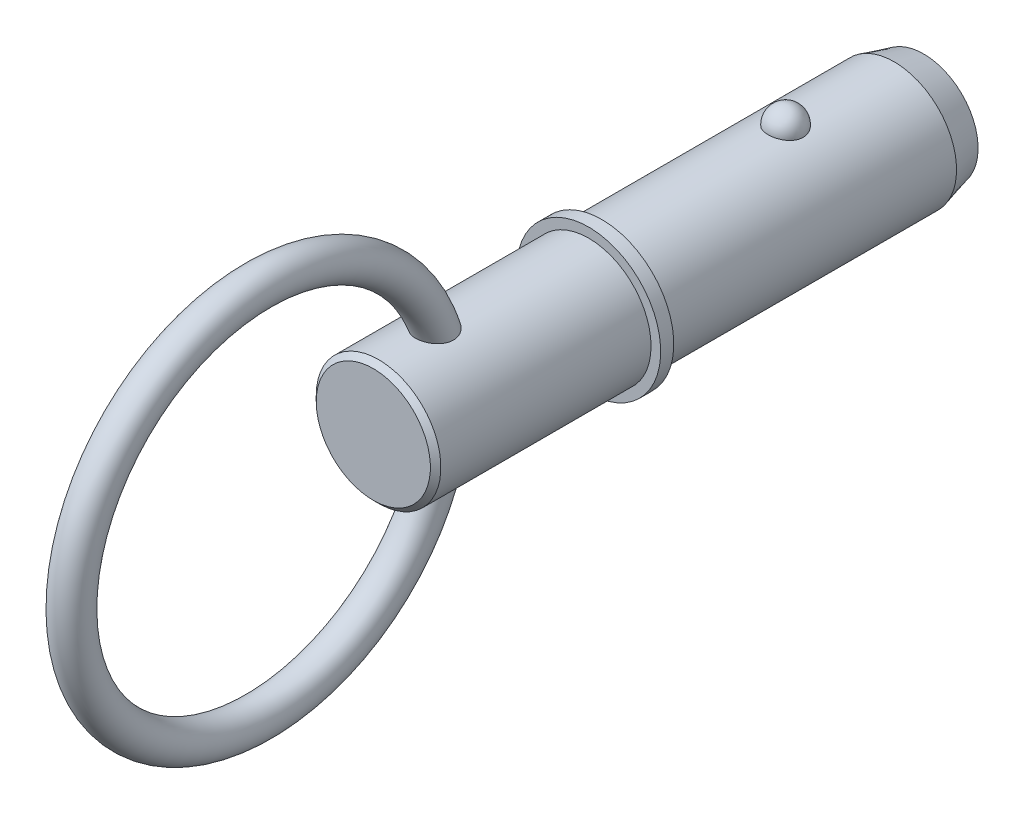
from build123d import *

# Parameters (mm, degrees)
SKETCH2_R           = 9.525
BOSS_EXTRUDE1_DEPTH = 25.4
BOSS_EXTRUDE2_START = 23.8
SKETCH3_R           = 9.525
BOSS_EXTRUDE2_DEPTH = 23.8
CHAMFER1_SIZE       = 4.5
CHAMFER1_SIZE2      = 1.205771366
SKETCH20_W          = 2
SKETCH20_H          = 11
SKETCH21_R          = 9.525
BOSS_EXTRUDE3_DEPTH = 34.93
CHAMFER2_SIZE       = 0.8
SKETCH24_R          = 2.75


with BuildPart() as part:
    # Sketch2 → Boss-Extrude1 (new body)
    with BuildSketch(Plane.XY):
        Circle(SKETCH2_R)
    extrude(amount=BOSS_EXTRUDE1_DEPTH)

    # Sketch3 → Boss-Extrude2 (add)
    with BuildSketch(Plane(origin=(0, 0, 0), x_dir=(-1, 0, 0), z_dir=(0, 0, -1)).offset(BOSS_EXTRUDE2_START)):
        Circle(SKETCH3_R)
    extrude(amount=-BOSS_EXTRUDE2_DEPTH)

    # Chamfer1
    chamfer1_edges = [part.edges().sort_by_distance(p)[0] for p in [
        (9.525, 0, -23.8),
    ]]
    chamfer1_side = [part.faces().sort_by_distance(p)[0] for p in [
        (9.525, 0, -11.9),
    ]]
    chamfer(chamfer1_edges, length=CHAMFER1_SIZE, length2=CHAMFER1_SIZE2, reference=chamfer1_side[0])

    # Sketch18 → Revolve1 (revolve)
    with BuildSketch(Plane(origin=(0, 0, 0), x_dir=(0, 0, -1), z_dir=(1, 0, 0))):
        with BuildLine():
            Line((2.69, 12.215), (2.69, 6.835))
            ThreePointArc((2.69, 6.835), (0, 9.525), (2.69, 12.215))
        make_face()
    revolve(axis=Axis((0, 12.215, -2.69), (0, -1, 0)))

    # Sketch20 → Revolve2 (revolve)
    with BuildSketch(Plane(origin=(0, 0, 0), x_dir=(0, 0, -1), z_dir=(1, 0, 0)), mode=Mode.PRIVATE) as revolve2_sk:
        with Locations((-26.4, 5.5)):
            Rectangle(SKETCH20_W, SKETCH20_H)
    revolve(revolve2_sk.sketch.rotate(Axis((0, 0, 33.728787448), (0, 0, 1)), 90), axis=Axis((0, 0, 33.728787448), (0, 0, 1)))

    # Sketch21 → Boss-Extrude3 (add)
    with BuildSketch(Plane(origin=(0, 0, 25.4), x_dir=(-1, 0, 0), z_dir=(0, 0, -1))):
        Circle(SKETCH21_R)
    extrude(amount=-BOSS_EXTRUDE3_DEPTH)

    # Chamfer2
    chamfer2_edges = [part.edges().sort_by_distance(p)[0] for p in [
        (9.525, 0, 60.33),
    ]]
    chamfer(chamfer2_edges, length=CHAMFER2_SIZE)

    # Sweep1: sweep along a path in Sketch23
    with BuildLine(Plane(origin=(0, 0, 0), x_dir=(0, 0, -1), z_dir=(1, 0, 0))) as sweep1_path:
        CenterArc((-77.905, 0), 28.575, 0, 360)
    # Sketch24 → Sweep1 (sweep)
    with BuildSketch(Plane(origin=(0, 0, 0), x_dir=(1, 0, 0), z_dir=(0, 1, 0))):
        with Locations((0, -49.33)):
            Circle(SKETCH24_R)
    sweep(path=sweep1_path.line)


solid = part.part
